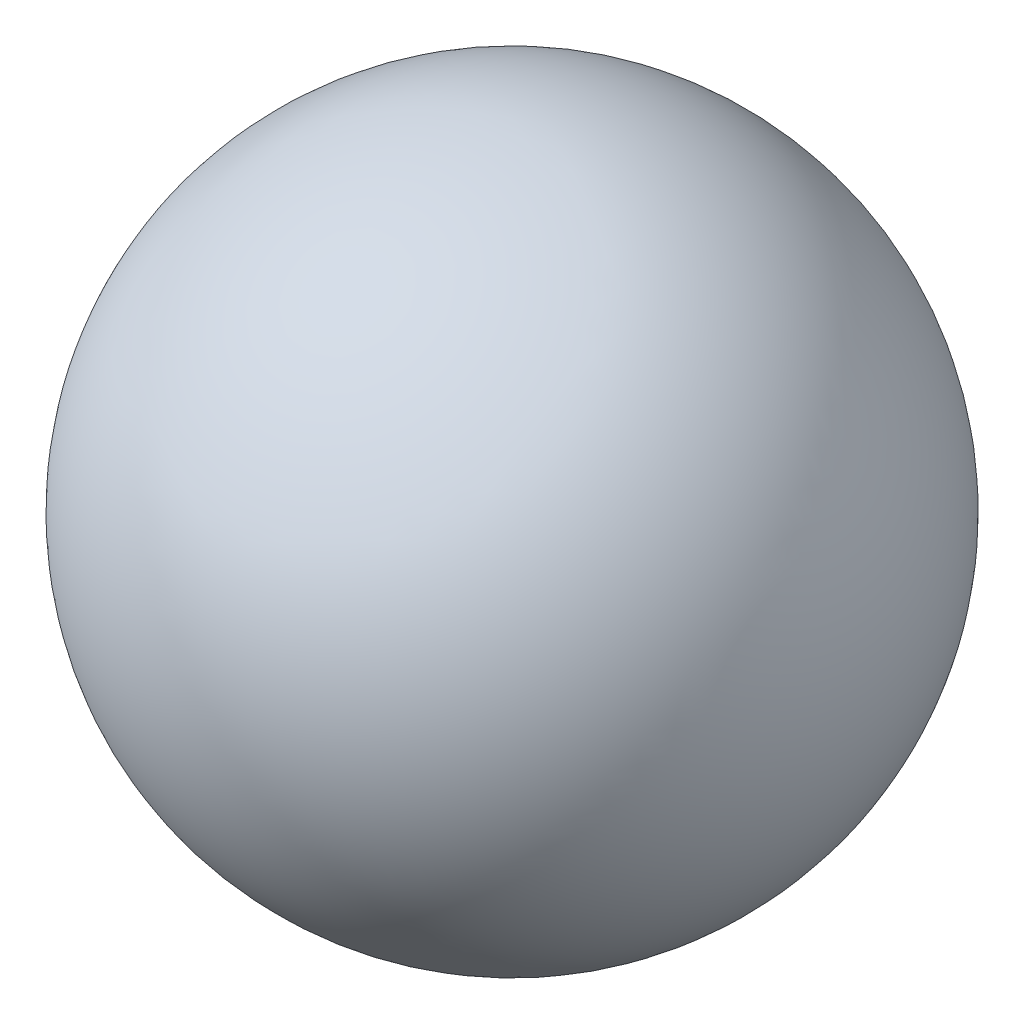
from build123d import *


with BuildPart() as part:
    # Sketch1 → Revolve1 (revolve)
    with BuildSketch(Plane.XY):
        with BuildLine():
            Line((5.3, 7.15), (1.7, 7.15))
            ThreePointArc((1.7, 7.15), (3.5, 8.95), (5.3, 7.15))
        make_face()
    revolve(axis=Axis((49.91675711, 7.15, 0), (-1, 0, 0)))


solid = part.part
